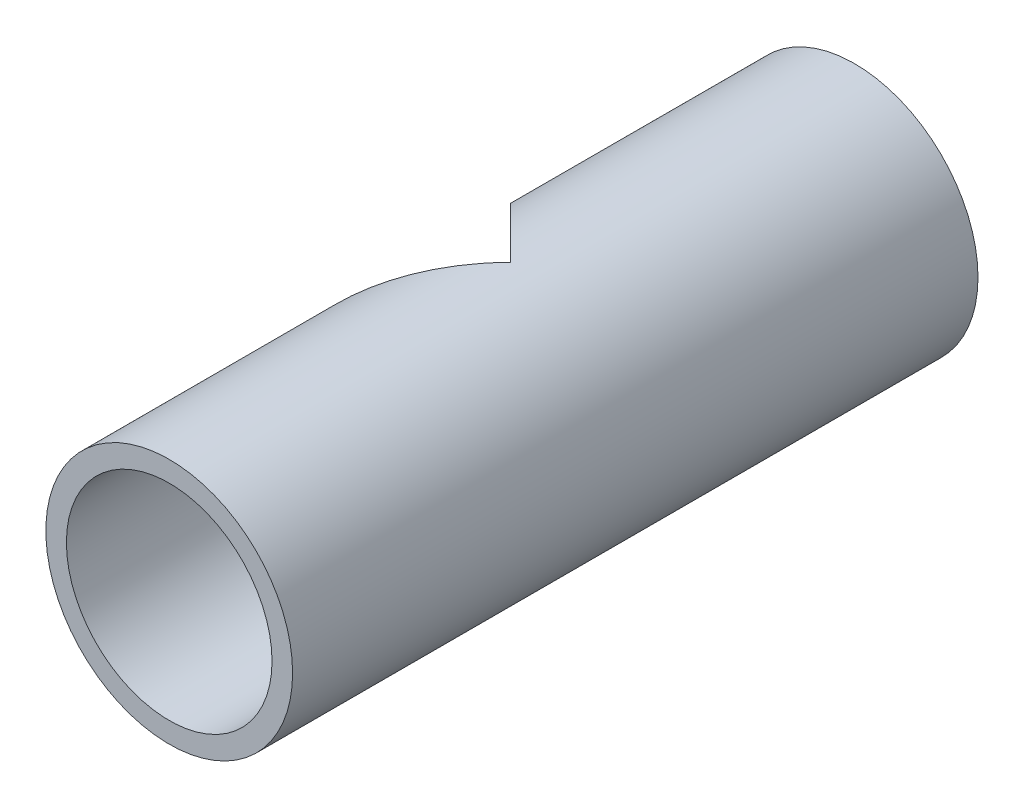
ISO-10303-21;
HEADER;
FILE_DESCRIPTION(('STEP AP214'),'2;1');
FILE_NAME('part.step','',(''),(''),'','','');
FILE_SCHEMA(('AUTOMOTIVE_DESIGN { 1 0 10303 214 1 1 1 1 }'));
ENDSEC;
DATA;
#1=APPLICATION_CONTEXT('core data for automotive mechanical design processes');
#2=APPLICATION_PROTOCOL_DEFINITION('international standard','automotive_design',2000,#1);
#3=PRODUCT_CONTEXT('',#1,'mechanical');
#4=PRODUCT('Part','Part','',(#3));
#5=PRODUCT_RELATED_PRODUCT_CATEGORY('part','',(#4));
#6=PRODUCT_DEFINITION_FORMATION('','',#4);
#7=PRODUCT_DEFINITION_CONTEXT('part definition',#1,'design');
#8=PRODUCT_DEFINITION('design','',#6,#7);
#9=PRODUCT_DEFINITION_SHAPE('','',#8);
#10=(LENGTH_UNIT() NAMED_UNIT(*) SI_UNIT(.MILLI.,.METRE.));
#11=(NAMED_UNIT(*) PLANE_ANGLE_UNIT() SI_UNIT($,.RADIAN.));
#12=(NAMED_UNIT(*) SI_UNIT($,.STERADIAN.) SOLID_ANGLE_UNIT());
#13=UNCERTAINTY_MEASURE_WITH_UNIT(LENGTH_MEASURE(1.E-05),#10,'distance_accuracy_value','');
#14=(GEOMETRIC_REPRESENTATION_CONTEXT(3) GLOBAL_UNCERTAINTY_ASSIGNED_CONTEXT((#13)) GLOBAL_UNIT_ASSIGNED_CONTEXT((#10,
#11,#12)) REPRESENTATION_CONTEXT('',''));
#15=CARTESIAN_POINT('',(0.,0.,0.));
#16=DIRECTION('',(0.,0.,1.));
#17=DIRECTION('',(1.,0.,0.));
#18=AXIS2_PLACEMENT_3D('',#15,#16,#17);
#19=CARTESIAN_POINT('',(0.,0.,100.));
#20=DIRECTION('',(0.,0.,1.));
#21=DIRECTION('',(1.,0.,0.));
#22=AXIS2_PLACEMENT_3D('',#19,#20,#21);
#23=PLANE('',#22);
#24=CARTESIAN_POINT('',(0.,0.,100.));
#25=DIRECTION('',(0.,0.,1.));
#26=DIRECTION('',(1.,0.,0.));
#27=AXIS2_PLACEMENT_3D('',#24,#25,#26);
#28=CIRCLE('',#27,18.);
#29=CARTESIAN_POINT('',(18.,0.,100.));
#30=VERTEX_POINT('',#29);
#31=EDGE_CURVE('E96',#30,#30,#28,.T.);
#32=ORIENTED_EDGE('',*,*,#31,.T.);
#33=EDGE_LOOP('',(#32));
#34=FACE_BOUND('',#33,.T.);
#35=CARTESIAN_POINT('',(0.,0.,100.));
#36=DIRECTION('',(0.,0.,1.));
#37=DIRECTION('',(1.,0.,0.));
#38=AXIS2_PLACEMENT_3D('',#35,#36,#37);
#39=CIRCLE('',#38,15.);
#40=CARTESIAN_POINT('',(15.,0.,100.));
#41=VERTEX_POINT('',#40);
#42=EDGE_CURVE('E90',#41,#41,#39,.T.);
#43=ORIENTED_EDGE('',*,*,#42,.F.);
#44=EDGE_LOOP('',(#43));
#45=FACE_BOUND('',#44,.T.);
#46=ADVANCED_FACE('F34',(#34,#45),#23,.T.);
#47=CARTESIAN_POINT('',(0.,0.,0.));
#48=DIRECTION('',(0.,0.,1.));
#49=DIRECTION('',(1.,0.,0.));
#50=AXIS2_PLACEMENT_3D('',#47,#48,#49);
#51=PLANE('',#50);
#52=CARTESIAN_POINT('',(0.,0.,0.));
#53=DIRECTION('',(0.,0.,1.));
#54=DIRECTION('',(1.,0.,0.));
#55=AXIS2_PLACEMENT_3D('',#52,#53,#54);
#56=CIRCLE('',#55,18.);
#57=CARTESIAN_POINT('',(18.,0.,0.));
#58=VERTEX_POINT('',#57);
#59=EDGE_CURVE('E94',#58,#58,#56,.T.);
#60=ORIENTED_EDGE('',*,*,#59,.F.);
#61=EDGE_LOOP('',(#60));
#62=FACE_BOUND('',#61,.T.);
#63=CARTESIAN_POINT('',(0.,0.,0.));
#64=DIRECTION('',(0.,0.,1.));
#65=DIRECTION('',(1.,0.,0.));
#66=AXIS2_PLACEMENT_3D('',#63,#64,#65);
#67=CIRCLE('',#66,15.);
#68=CARTESIAN_POINT('',(15.,0.,0.));
#69=VERTEX_POINT('',#68);
#70=EDGE_CURVE('E87',#69,#69,#67,.T.);
#71=ORIENTED_EDGE('',*,*,#70,.T.);
#72=EDGE_LOOP('',(#71));
#73=FACE_BOUND('',#72,.T.);
#74=ADVANCED_FACE('F125',(#62,#73),#51,.F.);
#75=CARTESIAN_POINT('',(0.,0.,100.));
#76=DIRECTION('',(0.,0.,-1.));
#77=DIRECTION('',(-1.,0.,0.));
#78=AXIS2_PLACEMENT_3D('',#75,#76,#77);
#79=CYLINDRICAL_SURFACE('',#78,18.);
#80=CARTESIAN_POINT('',(0.,0.,50.2241357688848));
#81=DIRECTION('',(-0.707106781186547,0.,-0.707106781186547));
#82=DIRECTION('',(0.707106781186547,0.,-0.707106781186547));
#83=AXIS2_PLACEMENT_3D('',#80,#81,#82);
#84=ELLIPSE('',#83,25.4558441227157,18.);
#85=CARTESIAN_POINT('',(0.,18.,50.2241357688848));
#86=VERTEX_POINT('',#85);
#87=CARTESIAN_POINT('',(0.,-18.,50.2241357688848));
#88=VERTEX_POINT('',#87);
#89=EDGE_CURVE('E68',#86,#88,#84,.F.);
#90=ORIENTED_EDGE('',*,*,#89,.T.);
#91=CARTESIAN_POINT('',(0.,0.,50.2241357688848));
#92=DIRECTION('',(0.707106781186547,0.,-0.707106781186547));
#93=DIRECTION('',(-0.707106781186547,0.,-0.707106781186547));
#94=AXIS2_PLACEMENT_3D('',#91,#92,#93);
#95=ELLIPSE('',#94,25.4558441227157,18.);
#96=EDGE_CURVE('E74',#88,#86,#95,.T.);
#97=ORIENTED_EDGE('',*,*,#96,.T.);
#98=EDGE_LOOP('',(#90,#97));
#99=FACE_BOUND('',#98,.T.);
#100=ORIENTED_EDGE('',*,*,#31,.F.);
#101=EDGE_LOOP('',(#100));
#102=FACE_BOUND('',#101,.T.);
#103=ORIENTED_EDGE('',*,*,#59,.T.);
#104=EDGE_LOOP('',(#103));
#105=FACE_BOUND('',#104,.T.);
#106=ADVANCED_FACE('F36',(#99,#102,#105),#79,.T.);
#107=CARTESIAN_POINT('',(0.,0.,100.));
#108=DIRECTION('',(0.,0.,-1.));
#109=DIRECTION('',(-1.,0.,0.));
#110=AXIS2_PLACEMENT_3D('',#107,#108,#109);
#111=CYLINDRICAL_SURFACE('',#110,15.);
#112=DIRECTION('',(0.,0.,-1.));
#113=VECTOR('',#112,1.);
#114=CARTESIAN_POINT('',(0.,-15.,100.));
#115=LINE('',#114,#113);
#116=CARTESIAN_POINT('',(0.,-15.,60.174010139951));
#117=VERTEX_POINT('',#116);
#118=CARTESIAN_POINT('',(0.,-15.,40.2742613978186));
#119=VERTEX_POINT('',#118);
#120=EDGE_CURVE('E11',#117,#119,#115,.T.);
#121=ORIENTED_EDGE('',*,*,#120,.F.);
#122=CARTESIAN_POINT('',(0.,15.,60.174010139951));
#123=CARTESIAN_POINT('',(-0.133991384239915,15.0000024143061,60.1740013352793));
#124=CARTESIAN_POINT('',(-0.267961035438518,14.9982040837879,60.176718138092));
#125=CARTESIAN_POINT('',(-0.535569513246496,14.9910329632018,60.1875183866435));
#126=CARTESIAN_POINT('',(-0.669208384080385,14.9856606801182,60.1956010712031));
#127=CARTESIAN_POINT('',(-1.06868290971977,14.9642533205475,60.2277262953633));
#128=CARTESIAN_POINT('',(-1.33365349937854,14.9429274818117,60.2596467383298));
#129=CARTESIAN_POINT('',(-1.85512570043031,14.887119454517,60.3422423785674));
#130=CARTESIAN_POINT('',(-2.11169452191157,14.8528347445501,60.3926357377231));
#131=CARTESIAN_POINT('',(-2.61910480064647,14.7718093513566,60.5099864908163));
#132=CARTESIAN_POINT('',(-2.86994300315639,14.7250617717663,60.5769530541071));
#133=CARTESIAN_POINT('',(-3.46313995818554,14.5990263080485,60.754305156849));
#134=CARTESIAN_POINT('',(-3.80232120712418,14.5141867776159,60.8713755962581));
#135=CARTESIAN_POINT('',(-4.46668618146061,14.323696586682,61.1262922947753));
#136=CARTESIAN_POINT('',(-4.79186421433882,14.218037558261,61.2641469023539));
#137=CARTESIAN_POINT('',(-5.43079091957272,13.9865246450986,61.5560416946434));
#138=CARTESIAN_POINT('',(-5.74442892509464,13.8605177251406,61.7102012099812));
#139=CARTESIAN_POINT('',(-6.35798287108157,13.5900128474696,62.029020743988));
#140=CARTESIAN_POINT('',(-6.65789908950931,13.4455152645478,62.1936805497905));
#141=CARTESIAN_POINT('',(-7.37445948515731,13.0707903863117,62.6040378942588));
#142=CARTESIAN_POINT('',(-7.7840219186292,12.8309236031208,62.8533495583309));
#143=CARTESIAN_POINT('',(-8.57677470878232,12.3151364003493,63.3568253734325));
#144=CARTESIAN_POINT('',(-8.9599538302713,12.0392007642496,63.6109915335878));
#145=CARTESIAN_POINT('',(-9.6988270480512,11.4522848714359,64.1163947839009));
#146=CARTESIAN_POINT('',(-10.0545790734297,11.1413820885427,64.3676370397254));
#147=CARTESIAN_POINT('',(-10.7381178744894,10.4841526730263,64.8614657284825));
#148=CARTESIAN_POINT('',(-11.0659152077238,10.1378395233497,65.1040554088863));
#149=CARTESIAN_POINT('',(-11.6250097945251,9.48694738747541,65.5249405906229));
#150=CARTESIAN_POINT('',(-11.8620453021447,9.18905384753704,65.7059750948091));
#151=CARTESIAN_POINT('',(-12.3156921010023,8.57149271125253,66.0562387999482));
#152=CARTESIAN_POINT('',(-12.5323041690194,8.25182594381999,66.2254684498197));
#153=CARTESIAN_POINT('',(-12.9428779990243,7.5916299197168,66.5490293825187));
#154=CARTESIAN_POINT('',(-13.1368642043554,7.25112379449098,66.7033767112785));
#155=CARTESIAN_POINT('',(-13.5001411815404,6.54996109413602,66.9944069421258));
#156=CARTESIAN_POINT('',(-13.6694364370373,6.18930819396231,67.1310930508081));
#157=CARTESIAN_POINT('',(-13.9539143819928,5.51348177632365,67.3619909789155));
#158=CARTESIAN_POINT('',(-14.0733922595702,5.20122445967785,67.4594605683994));
#159=CARTESIAN_POINT('',(-14.2923103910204,4.56539794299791,67.6386751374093));
#160=CARTESIAN_POINT('',(-14.3917544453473,4.24183090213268,67.7204230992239));
#161=CARTESIAN_POINT('',(-14.5692174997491,3.58518028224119,67.8666858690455));
#162=CARTESIAN_POINT('',(-14.6472447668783,3.25210043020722,67.9312073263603));
#163=CARTESIAN_POINT('',(-14.7807220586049,2.57840285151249,68.041777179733));
#164=CARTESIAN_POINT('',(-14.8361718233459,2.23778503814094,68.0878253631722));
#165=CARTESIAN_POINT('',(-14.9237437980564,1.55001435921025,68.1606218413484));
#166=CARTESIAN_POINT('',(-14.9557656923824,1.20283984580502,68.1872871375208));
#167=CARTESIAN_POINT('',(-14.995518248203,0.506133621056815,68.2203977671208));
#168=CARTESIAN_POINT('',(-15.0032488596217,0.156601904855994,68.2268430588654));
#169=CARTESIAN_POINT('',(-14.9942765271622,-0.541920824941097,68.2193663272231));
#170=CARTESIAN_POINT('',(-14.9775739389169,-0.890911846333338,68.2054446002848));
#171=CARTESIAN_POINT('',(-14.9200415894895,-1.58549395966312,68.1575511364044));
#172=CARTESIAN_POINT('',(-14.8792126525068,-1.93108516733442,68.1235800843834));
#173=CARTESIAN_POINT('',(-14.7776927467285,-2.59312756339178,68.0392827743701));
#174=CARTESIAN_POINT('',(-14.7185229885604,-2.90997488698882,67.9902107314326));
#175=CARTESIAN_POINT('',(-14.5806846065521,-3.53645313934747,67.8761856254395));
#176=CARTESIAN_POINT('',(-14.5020170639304,-3.84608446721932,67.8112334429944));
#177=CARTESIAN_POINT('',(-14.326217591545,-4.45649866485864,67.6665558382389));
#178=CARTESIAN_POINT('',(-14.2290857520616,-4.75728157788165,67.5868304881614));
#179=CARTESIAN_POINT('',(-14.0174902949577,-5.34870385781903,67.4138513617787));
#180=CARTESIAN_POINT('',(-13.9030243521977,-5.6393418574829,67.320595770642));
#181=CARTESIAN_POINT('',(-13.6474702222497,-6.2337770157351,67.1134038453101));
#182=CARTESIAN_POINT('',(-13.5049428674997,-6.53657599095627,66.9983812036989));
#183=CARTESIAN_POINT('',(-13.2023504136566,-7.12799445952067,66.7557383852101));
#184=CARTESIAN_POINT('',(-13.0422847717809,-7.41661351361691,66.6281178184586));
#185=CARTESIAN_POINT('',(-12.7058866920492,-7.97921924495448,66.3619473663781));
#186=CARTESIAN_POINT('',(-12.529543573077,-8.25319612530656,66.2233903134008));
#187=CARTESIAN_POINT('',(-12.1619064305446,-8.78594401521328,65.9371454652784));
#188=CARTESIAN_POINT('',(-11.970609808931,-9.04471236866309,65.7894560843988));
#189=CARTESIAN_POINT('',(-11.479804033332,-9.6662807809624,65.4145975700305));
#190=CARTESIAN_POINT('',(-11.1721054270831,-10.0200145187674,65.1830394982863));
#191=CARTESIAN_POINT('',(-10.5291006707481,-10.6936923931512,64.7091167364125));
#192=CARTESIAN_POINT('',(-10.1937819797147,-11.0136210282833,64.4667471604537));
#193=CARTESIAN_POINT('',(-9.49674180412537,-11.6200546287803,63.9764654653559));
#194=CARTESIAN_POINT('',(-9.13497836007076,-11.9065045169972,63.7285449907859));
#195=CARTESIAN_POINT('',(-8.38630821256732,-12.4451795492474,63.2337885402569));
#196=CARTESIAN_POINT('',(-7.99941066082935,-12.6974170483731,62.9869522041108));
#197=CARTESIAN_POINT('',(-7.30645778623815,-13.1046304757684,62.5663457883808));
#198=CARTESIAN_POINT('',(-7.00628356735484,-13.2676277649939,62.3906098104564));
#199=CARTESIAN_POINT('',(-6.39164944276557,-13.5744174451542,62.0473388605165));
#200=CARTESIAN_POINT('',(-6.07718855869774,-13.7182085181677,61.879804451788));
#201=CARTESIAN_POINT('',(-5.43412644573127,-13.9853946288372,61.5578205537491));
#202=CARTESIAN_POINT('',(-5.10555619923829,-14.1088317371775,61.4033444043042));
#203=CARTESIAN_POINT('',(-4.43328943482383,-14.3342768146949,61.1127674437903));
#204=CARTESIAN_POINT('',(-4.08960063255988,-14.4362955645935,60.9766574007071));
#205=CARTESIAN_POINT('',(-3.49628428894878,-14.5889866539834,60.7679801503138));
#206=CARTESIAN_POINT('',(-3.25055067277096,-14.645769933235,60.6887991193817));
#207=CARTESIAN_POINT('',(-2.75249788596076,-14.7474845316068,60.544962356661));
#208=CARTESIAN_POINT('',(-2.50018119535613,-14.7924202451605,60.4803012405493));
#209=CARTESIAN_POINT('',(-1.99060997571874,-14.8695553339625,60.3681468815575));
#210=CARTESIAN_POINT('',(-1.73337224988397,-14.9017919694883,60.3206034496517));
#211=CARTESIAN_POINT('',(-1.21487702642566,-14.9529869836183,60.2446304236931));
#212=CARTESIAN_POINT('',(-0.953622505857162,-14.9719547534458,60.2161873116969));
#213=CARTESIAN_POINT('',(-0.576448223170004,-14.9893624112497,60.190031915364));
#214=CARTESIAN_POINT('',(-0.461295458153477,-14.9933484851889,60.1840319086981));
#215=CARTESIAN_POINT('',(-0.230767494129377,-14.9986679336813,60.1760188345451));
#216=CARTESIAN_POINT('',(-0.115392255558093,-15.0000007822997,60.1740065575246));
#217=CARTESIAN_POINT('',(0.,-15.,60.174010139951));
#218=B_SPLINE_CURVE_WITH_KNOTS('',3,(#122,#123,#124,#125,#126,#127,#128,#129,#130,#131,#132,
#133,#134,#135,#136,#137,#138,#139,#140,#141,#142,#143,#144,#145,#146,#147,#148,#149,#150,#151,
#152,#153,#154,#155,#156,#157,#158,#159,#160,#161,#162,#163,#164,#165,#166,#167,#168,#169,#170,
#171,#172,#173,#174,#175,#176,#177,#178,#179,#180,#181,#182,#183,#184,#185,#186,#187,#188,#189,
#190,#191,#192,#193,#194,#195,#196,#197,#198,#199,#200,#201,#202,#203,#204,#205,#206,#207,#208,
#209,#210,#211,#212,#213,#214,#215,#216,#217),.UNSPECIFIED.,.F.,.F.,(4,2,2,2,2,2,2,2,2,2,2,2,2,
2,2,2,2,2,2,2,2,2,2,2,2,2,2,2,2,2,2,2,2,2,2,2,2,2,2,2,2,2,2,2,2,2,2,4),(0.,0.401892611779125,
0.803728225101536,1.60567562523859,2.39586512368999,3.18649278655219,4.29082917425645,
5.39561033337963,6.50912463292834,7.62261636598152,9.22889105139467,10.8358455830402,
12.4393073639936,14.0421608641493,15.3056919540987,16.5691749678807,17.831280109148,
19.0931557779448,20.1368837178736,21.1804134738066,22.2235398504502,23.2666782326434,
24.3142574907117,25.3618389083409,26.4094050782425,27.4569354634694,28.4339848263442,
29.4109800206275,30.3879704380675,31.3650920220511,32.4257215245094,33.4863838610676,
34.5477472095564,35.6092953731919,37.1758024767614,38.7430248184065,40.3127902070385,
41.8819871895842,43.0336545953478,44.1854009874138,45.3347360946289,46.4834913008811,
47.2758968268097,48.0680080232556,48.8577774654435,49.6469873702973,49.9930369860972,
50.339155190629),.UNSPECIFIED.);
#219=CARTESIAN_POINT('',(0.,15.,60.174010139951));
#220=VERTEX_POINT('',#219);
#221=EDGE_CURVE('E102',#220,#117,#218,.T.);
#222=ORIENTED_EDGE('',*,*,#221,.F.);
#223=DIRECTION('',(0.,0.,-1.));
#224=VECTOR('',#223,1.);
#225=CARTESIAN_POINT('',(0.,15.,100.));
#226=LINE('',#225,#224);
#227=CARTESIAN_POINT('',(0.,15.,40.2742613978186));
#228=VERTEX_POINT('',#227);
#229=EDGE_CURVE('E78',#228,#220,#226,.F.);
#230=ORIENTED_EDGE('',*,*,#229,.F.);
#231=CARTESIAN_POINT('',(0.,-15.,40.2742613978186));
#232=CARTESIAN_POINT('',(-0.133991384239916,-15.0000024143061,40.2742702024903));
#233=CARTESIAN_POINT('',(-0.267961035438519,-14.9982040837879,40.2715533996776));
#234=CARTESIAN_POINT('',(-0.535569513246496,-14.9910329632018,40.2607531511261));
#235=CARTESIAN_POINT('',(-0.669208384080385,-14.9856606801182,40.2526704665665));
#236=CARTESIAN_POINT('',(-1.06868290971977,-14.9642533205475,40.2205452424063));
#237=CARTESIAN_POINT('',(-1.33365349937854,-14.9429274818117,40.1886247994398));
#238=CARTESIAN_POINT('',(-1.85512570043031,-14.887119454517,40.1060291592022));
#239=CARTESIAN_POINT('',(-2.11169452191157,-14.8528347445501,40.0556358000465));
#240=CARTESIAN_POINT('',(-2.61910480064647,-14.7718093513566,39.9382850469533));
#241=CARTESIAN_POINT('',(-2.86994300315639,-14.7250617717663,39.8713184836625));
#242=CARTESIAN_POINT('',(-3.46313995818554,-14.5990263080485,39.6939663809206));
#243=CARTESIAN_POINT('',(-3.80232120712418,-14.5141867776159,39.5768959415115));
#244=CARTESIAN_POINT('',(-4.46668618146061,-14.323696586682,39.3219792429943));
#245=CARTESIAN_POINT('',(-4.79186421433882,-14.218037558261,39.1841246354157));
#246=CARTESIAN_POINT('',(-5.43079091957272,-13.9865246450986,38.8922298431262));
#247=CARTESIAN_POINT('',(-5.74442892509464,-13.8605177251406,38.7380703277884));
#248=CARTESIAN_POINT('',(-6.35798287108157,-13.5900128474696,38.4192507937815));
#249=CARTESIAN_POINT('',(-6.65789908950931,-13.4455152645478,38.254590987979));
#250=CARTESIAN_POINT('',(-7.37445948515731,-13.0707903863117,37.8442336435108));
#251=CARTESIAN_POINT('',(-7.78402191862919,-12.8309236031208,37.5949219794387));
#252=CARTESIAN_POINT('',(-8.57677470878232,-12.3151364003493,37.091446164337));
#253=CARTESIAN_POINT('',(-8.9599538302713,-12.0392007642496,36.8372800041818));
#254=CARTESIAN_POINT('',(-9.6988270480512,-11.4522848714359,36.3318767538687));
#255=CARTESIAN_POINT('',(-10.0545790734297,-11.1413820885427,36.0806344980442));
#256=CARTESIAN_POINT('',(-10.7381178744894,-10.4841526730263,35.5868058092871));
#257=CARTESIAN_POINT('',(-11.0659152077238,-10.1378395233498,35.3442161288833));
#258=CARTESIAN_POINT('',(-11.6250097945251,-9.48694738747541,34.9233309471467));
#259=CARTESIAN_POINT('',(-11.8620453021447,-9.18905384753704,34.7422964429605));
#260=CARTESIAN_POINT('',(-12.3156921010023,-8.57149271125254,34.3920327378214));
#261=CARTESIAN_POINT('',(-12.5323041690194,-8.25182594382,34.2228030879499));
#262=CARTESIAN_POINT('',(-12.9428779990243,-7.5916299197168,33.8992421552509));
#263=CARTESIAN_POINT('',(-13.1368642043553,-7.25112379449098,33.7448948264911));
#264=CARTESIAN_POINT('',(-13.5001411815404,-6.54996109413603,33.4538645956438));
#265=CARTESIAN_POINT('',(-13.6694364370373,-6.18930819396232,33.3171784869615));
#266=CARTESIAN_POINT('',(-13.9539143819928,-5.51348177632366,33.0862805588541));
#267=CARTESIAN_POINT('',(-14.0733922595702,-5.20122445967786,32.9888109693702));
#268=CARTESIAN_POINT('',(-14.2923103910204,-4.56539794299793,32.8095964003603));
#269=CARTESIAN_POINT('',(-14.3917544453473,-4.24183090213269,32.7278484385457));
#270=CARTESIAN_POINT('',(-14.5692174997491,-3.5851802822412,32.5815856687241));
#271=CARTESIAN_POINT('',(-14.6472447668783,-3.25210043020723,32.5170642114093));
#272=CARTESIAN_POINT('',(-14.7807220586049,-2.5784028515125,32.4064943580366));
#273=CARTESIAN_POINT('',(-14.8361718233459,-2.23778503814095,32.3604461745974));
#274=CARTESIAN_POINT('',(-14.9237437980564,-1.55001435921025,32.2876496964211));
#275=CARTESIAN_POINT('',(-14.9557656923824,-1.20283984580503,32.2609844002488));
#276=CARTESIAN_POINT('',(-14.995518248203,-0.506133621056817,32.2278737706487));
#277=CARTESIAN_POINT('',(-15.0032488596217,-0.156601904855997,32.2214284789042));
#278=CARTESIAN_POINT('',(-14.9942765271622,0.541920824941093,32.2289052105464));
#279=CARTESIAN_POINT('',(-14.9775739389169,0.890911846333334,32.2428269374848));
#280=CARTESIAN_POINT('',(-14.9200415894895,1.58549395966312,32.2907204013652));
#281=CARTESIAN_POINT('',(-14.8792126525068,1.93108516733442,32.3246914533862));
#282=CARTESIAN_POINT('',(-14.7776927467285,2.59312756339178,32.4089887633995));
#283=CARTESIAN_POINT('',(-14.7185229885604,2.90997488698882,32.458060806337));
#284=CARTESIAN_POINT('',(-14.5806846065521,3.53645313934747,32.5720859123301));
#285=CARTESIAN_POINT('',(-14.5020170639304,3.84608446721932,32.6370380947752));
#286=CARTESIAN_POINT('',(-14.326217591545,4.45649866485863,32.7817156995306));
#287=CARTESIAN_POINT('',(-14.2290857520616,4.75728157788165,32.8614410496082));
#288=CARTESIAN_POINT('',(-14.0174902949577,5.34870385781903,33.0344201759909));
#289=CARTESIAN_POINT('',(-13.9030243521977,5.63934185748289,33.1276757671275));
#290=CARTESIAN_POINT('',(-13.6474702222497,6.2337770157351,33.3348676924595));
#291=CARTESIAN_POINT('',(-13.5049428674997,6.53657599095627,33.4498903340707));
#292=CARTESIAN_POINT('',(-13.2023504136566,7.12799445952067,33.6925331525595));
#293=CARTESIAN_POINT('',(-13.0422847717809,7.4166135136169,33.8201537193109));
#294=CARTESIAN_POINT('',(-12.7058866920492,7.97921924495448,34.0863241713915));
#295=CARTESIAN_POINT('',(-12.529543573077,8.25319612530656,34.2248812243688));
#296=CARTESIAN_POINT('',(-12.1619064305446,8.78594401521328,34.5111260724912));
#297=CARTESIAN_POINT('',(-11.970609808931,9.04471236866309,34.6588154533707));
#298=CARTESIAN_POINT('',(-11.479804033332,9.6662807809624,35.0336739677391));
#299=CARTESIAN_POINT('',(-11.1721054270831,10.0200145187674,35.2652320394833));
#300=CARTESIAN_POINT('',(-10.5291006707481,10.6936923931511,35.7391548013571));
#301=CARTESIAN_POINT('',(-10.1937819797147,11.0136210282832,35.9815243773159));
#302=CARTESIAN_POINT('',(-9.49674180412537,11.6200546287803,36.4718060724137));
#303=CARTESIAN_POINT('',(-9.13497836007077,11.9065045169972,36.7197265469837));
#304=CARTESIAN_POINT('',(-8.38630821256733,12.4451795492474,37.2144829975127));
#305=CARTESIAN_POINT('',(-7.99941066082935,12.6974170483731,37.4613193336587));
#306=CARTESIAN_POINT('',(-7.30645778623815,13.1046304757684,37.8819257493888));
#307=CARTESIAN_POINT('',(-7.00628356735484,13.2676277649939,38.0576617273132));
#308=CARTESIAN_POINT('',(-6.39164944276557,13.5744174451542,38.400932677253));
#309=CARTESIAN_POINT('',(-6.07718855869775,13.7182085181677,38.5684670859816));
#310=CARTESIAN_POINT('',(-5.43412644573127,13.9853946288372,38.8904509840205));
#311=CARTESIAN_POINT('',(-5.1055561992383,14.1088317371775,39.0449271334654));
#312=CARTESIAN_POINT('',(-4.43328943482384,14.3342768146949,39.3355040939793));
#313=CARTESIAN_POINT('',(-4.08960063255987,14.4362955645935,39.4716141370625));
#314=CARTESIAN_POINT('',(-3.49628428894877,14.5889866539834,39.6802913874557));
#315=CARTESIAN_POINT('',(-3.25055067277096,14.645769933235,39.7594724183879));
#316=CARTESIAN_POINT('',(-2.75249788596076,14.7474845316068,39.9033091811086));
#317=CARTESIAN_POINT('',(-2.50018119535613,14.7924202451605,39.9679702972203));
#318=CARTESIAN_POINT('',(-1.99060997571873,14.8695553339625,40.0801246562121));
#319=CARTESIAN_POINT('',(-1.73337224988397,14.9017919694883,40.1276680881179));
#320=CARTESIAN_POINT('',(-1.21487702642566,14.9529869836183,40.2036411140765));
#321=CARTESIAN_POINT('',(-0.95362250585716,14.9719547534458,40.2320842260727));
#322=CARTESIAN_POINT('',(-0.576448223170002,14.9893624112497,40.2582396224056));
#323=CARTESIAN_POINT('',(-0.461295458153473,14.9933484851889,40.2642396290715));
#324=CARTESIAN_POINT('',(-0.230767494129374,14.9986679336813,40.2722527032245));
#325=CARTESIAN_POINT('',(-0.115392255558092,15.0000007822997,40.274264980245));
#326=CARTESIAN_POINT('',(0.,15.,40.2742613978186));
#327=B_SPLINE_CURVE_WITH_KNOTS('',3,(#231,#232,#233,#234,#235,#236,#237,#238,#239,#240,#241,
#242,#243,#244,#245,#246,#247,#248,#249,#250,#251,#252,#253,#254,#255,#256,#257,#258,#259,#260,
#261,#262,#263,#264,#265,#266,#267,#268,#269,#270,#271,#272,#273,#274,#275,#276,#277,#278,#279,
#280,#281,#282,#283,#284,#285,#286,#287,#288,#289,#290,#291,#292,#293,#294,#295,#296,#297,#298,
#299,#300,#301,#302,#303,#304,#305,#306,#307,#308,#309,#310,#311,#312,#313,#314,#315,#316,#317,
#318,#319,#320,#321,#322,#323,#324,#325,#326),.UNSPECIFIED.,.F.,.F.,(4,2,2,2,2,2,2,2,2,2,2,2,2,
2,2,2,2,2,2,2,2,2,2,2,2,2,2,2,2,2,2,2,2,2,2,2,2,2,2,2,2,2,2,2,2,2,2,4),(0.,0.401892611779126,
0.803728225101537,1.60567562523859,2.39586512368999,3.18649278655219,4.29082917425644,
5.39561033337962,6.50912463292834,7.62261636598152,9.22889105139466,10.8358455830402,
12.4393073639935,14.0421608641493,15.3056919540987,16.5691749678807,17.831280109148,
19.0931557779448,20.1368837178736,21.1804134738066,22.2235398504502,23.2666782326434,
24.3142574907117,25.3618389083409,26.4094050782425,27.4569354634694,28.4339848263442,
29.4109800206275,30.3879704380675,31.3650920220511,32.4257215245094,33.4863838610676,
34.5477472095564,35.6092953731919,37.1758024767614,38.7430248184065,40.3127902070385,
41.8819871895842,43.0336545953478,44.1854009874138,45.3347360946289,46.4834913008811,
47.2758968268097,48.0680080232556,48.8577774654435,49.6469873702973,49.9930369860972,
50.339155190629),.UNSPECIFIED.);
#328=EDGE_CURVE('E42',#119,#228,#327,.T.);
#329=ORIENTED_EDGE('',*,*,#328,.F.);
#330=EDGE_LOOP('',(#121,#222,#230,#329));
#331=FACE_BOUND('',#330,.T.);
#332=ORIENTED_EDGE('',*,*,#42,.T.);
#333=EDGE_LOOP('',(#332));
#334=FACE_BOUND('',#333,.T.);
#335=ORIENTED_EDGE('',*,*,#70,.F.);
#336=EDGE_LOOP('',(#335));
#337=FACE_BOUND('',#336,.T.);
#338=ADVANCED_FACE('F111',(#331,#334,#337),#111,.F.);
#339=CARTESIAN_POINT('',(-30.,0.,50.2241357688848));
#340=DIRECTION('',(1.,0.,0.));
#341=DIRECTION('',(0.,0.,-1.));
#342=AXIS2_PLACEMENT_3D('',#339,#340,#341);
#343=CYLINDRICAL_SURFACE('',#342,18.);
#344=CARTESIAN_POINT('',(0.,0.,50.2241357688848));
#345=DIRECTION('',(1.,0.,0.));
#346=DIRECTION('',(0.,0.,-1.));
#347=AXIS2_PLACEMENT_3D('',#344,#345,#346);
#348=CIRCLE('',#347,18.);
#349=EDGE_CURVE('E85',#88,#119,#348,.T.);
#350=ORIENTED_EDGE('',*,*,#349,.T.);
#351=ORIENTED_EDGE('',*,*,#328,.T.);
#352=EDGE_CURVE('E57',#228,#86,#348,.T.);
#353=ORIENTED_EDGE('',*,*,#352,.T.);
#354=ORIENTED_EDGE('',*,*,#96,.F.);
#355=EDGE_LOOP('',(#350,#351,#353,#354));
#356=FACE_BOUND('',#355,.T.);
#357=ADVANCED_FACE('F83',(#356),#343,.F.);
#358=EDGE_CURVE('E70',#86,#220,#348,.T.);
#359=ORIENTED_EDGE('',*,*,#358,.T.);
#360=ORIENTED_EDGE('',*,*,#221,.T.);
#361=EDGE_CURVE('E49',#117,#88,#348,.T.);
#362=ORIENTED_EDGE('',*,*,#361,.T.);
#363=ORIENTED_EDGE('',*,*,#89,.F.);
#364=EDGE_LOOP('',(#359,#360,#362,#363));
#365=FACE_BOUND('',#364,.T.);
#366=ADVANCED_FACE('F69',(#365),#343,.F.);
#367=CARTESIAN_POINT('',(0.,0.,50.2241357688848));
#368=DIRECTION('',(1.,0.,0.));
#369=DIRECTION('',(0.,0.,-1.));
#370=AXIS2_PLACEMENT_3D('',#367,#368,#369);
#371=PLANE('',#370);
#372=ORIENTED_EDGE('',*,*,#120,.T.);
#373=ORIENTED_EDGE('',*,*,#349,.F.);
#374=ORIENTED_EDGE('',*,*,#361,.F.);
#375=EDGE_LOOP('',(#372,#373,#374));
#376=FACE_BOUND('',#375,.T.);
#377=ADVANCED_FACE('F119',(#376),#371,.F.);
#378=ORIENTED_EDGE('',*,*,#229,.T.);
#379=ORIENTED_EDGE('',*,*,#358,.F.);
#380=ORIENTED_EDGE('',*,*,#352,.F.);
#381=EDGE_LOOP('',(#378,#379,#380));
#382=FACE_BOUND('',#381,.T.);
#383=ADVANCED_FACE('F76',(#382),#371,.F.);
#384=CLOSED_SHELL('',(#46,#74,#106,#338,#357,#366,#377,#383));
#385=MANIFOLD_SOLID_BREP('B2',#384);
#386=ADVANCED_BREP_SHAPE_REPRESENTATION('',(#18,#385),#14);
#387=SHAPE_DEFINITION_REPRESENTATION(#9,#386);
ENDSEC;
END-ISO-10303-21;
